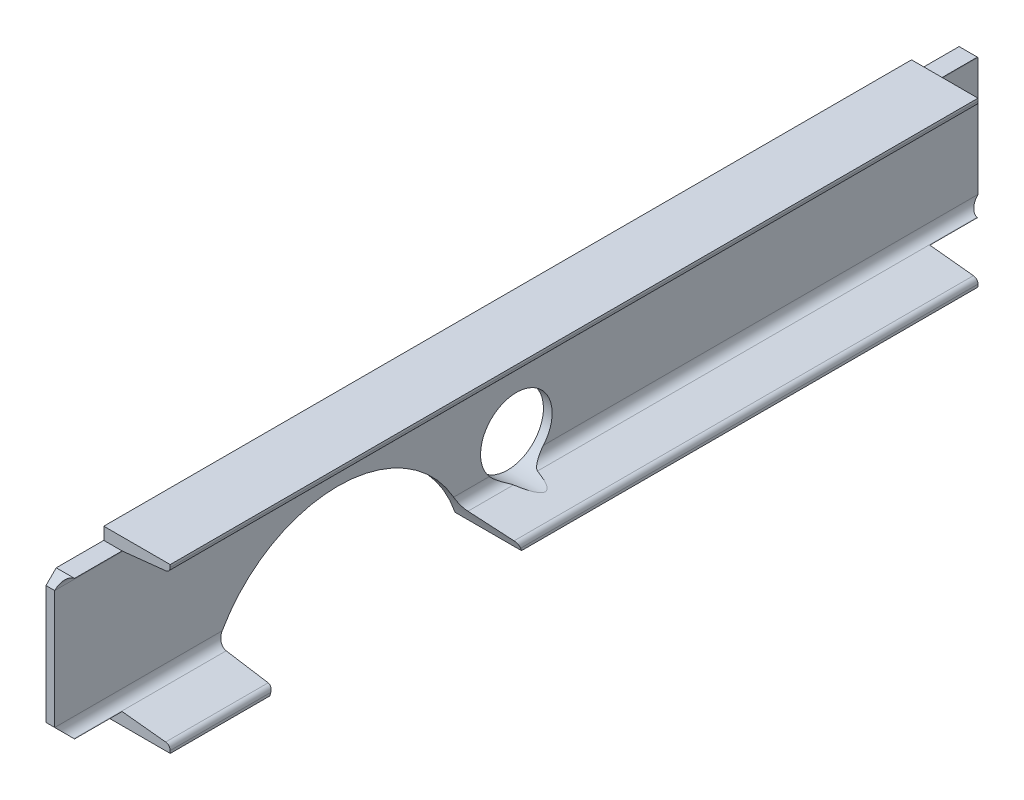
ISO-10303-21;
HEADER;
FILE_DESCRIPTION(('STEP AP214'),'2;1');
FILE_NAME('part.step','',(''),(''),'','','');
FILE_SCHEMA(('AUTOMOTIVE_DESIGN { 1 0 10303 214 1 1 1 1 }'));
ENDSEC;
DATA;
#1=APPLICATION_CONTEXT('core data for automotive mechanical design processes');
#2=APPLICATION_PROTOCOL_DEFINITION('international standard','automotive_design',2000,#1);
#3=PRODUCT_CONTEXT('',#1,'mechanical');
#4=PRODUCT('Part','Part','',(#3));
#5=PRODUCT_RELATED_PRODUCT_CATEGORY('part','',(#4));
#6=PRODUCT_DEFINITION_FORMATION('','',#4);
#7=PRODUCT_DEFINITION_CONTEXT('part definition',#1,'design');
#8=PRODUCT_DEFINITION('design','',#6,#7);
#9=PRODUCT_DEFINITION_SHAPE('','',#8);
#10=(LENGTH_UNIT() NAMED_UNIT(*) SI_UNIT(.MILLI.,.METRE.));
#11=(NAMED_UNIT(*) PLANE_ANGLE_UNIT() SI_UNIT($,.RADIAN.));
#12=(NAMED_UNIT(*) SI_UNIT($,.STERADIAN.) SOLID_ANGLE_UNIT());
#13=UNCERTAINTY_MEASURE_WITH_UNIT(LENGTH_MEASURE(1.E-05),#10,'distance_accuracy_value','');
#14=(GEOMETRIC_REPRESENTATION_CONTEXT(3) GLOBAL_UNCERTAINTY_ASSIGNED_CONTEXT((#13)) GLOBAL_UNIT_ASSIGNED_CONTEXT((#10,
#11,#12)) REPRESENTATION_CONTEXT('',''));
#15=CARTESIAN_POINT('',(0.,0.,0.));
#16=DIRECTION('',(0.,0.,1.));
#17=DIRECTION('',(1.,0.,0.));
#18=AXIS2_PLACEMENT_3D('',#15,#16,#17);
#19=CARTESIAN_POINT('',(18.5,-58.0057184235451,451.5));
#20=DIRECTION('',(0.,0.,-1.));
#21=DIRECTION('',(-1.,0.,0.));
#22=AXIS2_PLACEMENT_3D('',#19,#20,#21);
#23=CYLINDRICAL_SURFACE('',#22,9.99999999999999);
#24=DIRECTION('',(0.,0.,-1.));
#25=VECTOR('',#24,1.);
#26=CARTESIAN_POINT('',(17.4439908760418,-67.9498043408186,451.5));
#27=LINE('',#26,#25);
#28=CARTESIAN_POINT('',(17.4439908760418,-67.9498043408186,-11.8029824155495));
#29=VERTEX_POINT('',#28);
#30=CARTESIAN_POINT('',(17.4439908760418,-67.9498043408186,-441.550195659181));
#31=VERTEX_POINT('',#30);
#32=EDGE_CURVE('E301',#29,#31,#27,.T.);
#33=ORIENTED_EDGE('',*,*,#32,.T.);
#34=CARTESIAN_POINT('',(18.5,-58.0057184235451,-451.494281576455));
#35=DIRECTION('',(0.,-0.707106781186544,-0.707106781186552));
#36=DIRECTION('',(0.,0.707106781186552,-0.707106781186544));
#37=AXIS2_PLACEMENT_3D('',#34,#35,#36);
#38=ELLIPSE('',#37,14.1421356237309,9.99999999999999);
#39=CARTESIAN_POINT('',(8.50000000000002,-58.0057184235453,-451.494281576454));
#40=VERTEX_POINT('',#39);
#41=EDGE_CURVE('E362',#31,#40,#38,.T.);
#42=ORIENTED_EDGE('',*,*,#41,.T.);
#43=DIRECTION('',(0.,0.,-1.));
#44=VECTOR('',#43,1.);
#45=CARTESIAN_POINT('',(8.50000000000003,-58.0057184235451,451.5));
#46=LINE('',#45,#44);
#47=CARTESIAN_POINT('',(8.50000000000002,-58.0057184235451,-26.3768254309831));
#48=VERTEX_POINT('',#47);
#49=EDGE_CURVE('E299',#48,#40,#46,.T.);
#50=ORIENTED_EDGE('',*,*,#49,.F.);
#51=CARTESIAN_POINT('',(8.50000000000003,-58.0057184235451,-26.3768254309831));
#52=CARTESIAN_POINT('',(8.50004204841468,-58.3246674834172,-26.0986965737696));
#53=CARTESIAN_POINT('',(8.51525402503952,-58.6383669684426,-25.8148511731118));
#54=CARTESIAN_POINT('',(8.57335538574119,-59.253634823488,-25.2376332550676));
#55=CARTESIAN_POINT('',(8.61621529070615,-59.5552157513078,-24.9442712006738));
#56=CARTESIAN_POINT('',(8.72690583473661,-60.1450031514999,-24.3496253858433));
#57=CARTESIAN_POINT('',(8.79471138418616,-60.4332227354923,-24.048349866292));
#58=CARTESIAN_POINT('',(8.95306821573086,-60.9959636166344,-23.4388988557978));
#59=CARTESIAN_POINT('',(9.04362875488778,-61.2704792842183,-23.1307206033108));
#60=CARTESIAN_POINT('',(9.29859413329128,-61.9458168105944,-22.3453409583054));
#61=CARTESIAN_POINT('',(9.47679327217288,-62.337185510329,-21.8644400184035));
#62=CARTESIAN_POINT('',(9.87612784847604,-63.0859784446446,-20.8938679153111));
#63=CARTESIAN_POINT('',(10.0972833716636,-63.4433866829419,-20.4041927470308));
#64=CARTESIAN_POINT('',(10.4585684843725,-63.9537232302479,-19.6665059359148));
#65=CARTESIAN_POINT('',(10.58394523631,-64.1195646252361,-19.4200404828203));
#66=CARTESIAN_POINT('',(10.844364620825,-64.4426676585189,-18.9266014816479));
#67=CARTESIAN_POINT('',(10.9794064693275,-64.5999299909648,-18.6796279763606));
#68=CARTESIAN_POINT('',(11.2590192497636,-64.9057991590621,-18.1859141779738));
#69=CARTESIAN_POINT('',(11.4035858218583,-65.0544098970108,-17.9391738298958));
#70=CARTESIAN_POINT('',(11.7024141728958,-65.3430188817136,-17.4465661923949));
#71=CARTESIAN_POINT('',(11.8566748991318,-65.4830180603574,-17.2006988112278));
#72=CARTESIAN_POINT('',(12.1669784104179,-65.7473065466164,-16.7234454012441));
#73=CARTESIAN_POINT('',(12.3225116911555,-65.8720341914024,-16.4919709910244));
#74=CARTESIAN_POINT('',(12.6431649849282,-66.1136025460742,-16.0315718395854));
#75=CARTESIAN_POINT('',(12.8082843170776,-66.230443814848,-15.8026469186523));
#76=CARTESIAN_POINT('',(13.1493825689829,-66.456330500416,-15.3480886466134));
#77=CARTESIAN_POINT('',(13.3253859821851,-66.5653570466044,-15.1224642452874));
#78=CARTESIAN_POINT('',(13.6891808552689,-66.7749898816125,-14.676872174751));
#79=CARTESIAN_POINT('',(13.8769705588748,-66.8755974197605,-14.4569036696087));
#80=CARTESIAN_POINT('',(14.2239957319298,-67.0469932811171,-14.0721168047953));
#81=CARTESIAN_POINT('',(14.3805844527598,-67.1195148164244,-13.9056891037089));
#82=CARTESIAN_POINT('',(14.703446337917,-67.2586700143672,-13.5797491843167));
#83=CARTESIAN_POINT('',(14.8697221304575,-67.3253020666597,-13.4202388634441));
#84=CARTESIAN_POINT('',(15.2120769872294,-67.4514884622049,-13.1121453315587));
#85=CARTESIAN_POINT('',(15.3880639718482,-67.5110966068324,-12.9634829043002));
#86=CARTESIAN_POINT('',(15.7527350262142,-67.6228338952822,-12.6796662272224));
#87=CARTESIAN_POINT('',(15.9414092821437,-67.6749687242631,-12.5445017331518));
#88=CARTESIAN_POINT('',(16.3380869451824,-67.7714073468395,-12.2903903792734));
#89=CARTESIAN_POINT('',(16.5464331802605,-67.8155052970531,-12.1718839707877));
#90=CARTESIAN_POINT('',(16.872249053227,-67.8729745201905,-12.0154372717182));
#91=CARTESIAN_POINT('',(16.9837251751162,-67.890758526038,-11.9666306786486));
#92=CARTESIAN_POINT('',(17.2108309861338,-67.9229379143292,-11.8778102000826));
#93=CARTESIAN_POINT('',(17.3264681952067,-67.93732676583,-11.8378132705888));
#94=CARTESIAN_POINT('',(17.4439908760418,-67.9498043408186,-11.8029824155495));
#95=B_SPLINE_CURVE_WITH_KNOTS('',3,(#51,#52,#53,#54,#55,#56,#57,#58,#59,#60,#61,#62,#63,#64,#65,
#66,#67,#68,#69,#70,#71,#72,#73,#74,#75,#76,#77,#78,#79,#80,#81,#82,#83,#84,#85,#86,#87,#88,#89,
#90,#91,#92,#93,#94),.UNSPECIFIED.,.F.,.F.,(4,2,2,2,2,2,2,2,2,2,2,2,2,2,2,2,2,2,2,2,2,4),(0.,
1.26891953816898,2.53648834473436,3.80278573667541,5.06959911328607,7.00227511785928,
8.9358569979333,9.90296644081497,10.8699975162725,11.8365889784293,12.8030756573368,
13.7193204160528,14.635500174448,15.5538225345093,16.4720083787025,17.1909446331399,
17.9100768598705,18.6232828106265,19.335943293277,20.0648659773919,20.4334311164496,
20.8026995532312),.UNSPECIFIED.);
#96=EDGE_CURVE('E277',#48,#29,#95,.T.);
#97=ORIENTED_EDGE('',*,*,#96,.T.);
#98=EDGE_LOOP('',(#33,#42,#50,#97));
#99=FACE_BOUND('',#98,.T.);
#100=ADVANCED_FACE('F63',(#99),#23,.F.);
#101=CARTESIAN_POINT('',(0.,-80.,451.5));
#102=DIRECTION('',(0.,1.,0.));
#103=DIRECTION('',(-1.,0.,0.));
#104=AXIS2_PLACEMENT_3D('',#101,#102,#103);
#105=PLANE('',#104);
#106=DIRECTION('',(0.,0.,-1.));
#107=VECTOR('',#106,1.);
#108=CARTESIAN_POINT('',(65.,-80.,451.5));
#109=LINE('',#108,#107);
#110=CARTESIAN_POINT('',(65.,-80.,51.4715480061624));
#111=VERTEX_POINT('',#110);
#112=CARTESIAN_POINT('',(65.,-80.,-395.));
#113=VERTEX_POINT('',#112);
#114=EDGE_CURVE('E316',#111,#113,#109,.T.);
#115=ORIENTED_EDGE('',*,*,#114,.F.);
#116=DIRECTION('',(-1.,0.,0.));
#117=VECTOR('',#116,1.);
#118=CARTESIAN_POINT('',(65.,-80.,51.4715480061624));
#119=LINE('',#118,#117);
#120=CARTESIAN_POINT('',(0.,-80.,51.4715480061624));
#121=VERTEX_POINT('',#120);
#122=EDGE_CURVE('E517',#111,#121,#119,.T.);
#123=ORIENTED_EDGE('',*,*,#122,.T.);
#124=DIRECTION('',(0.,0.,-1.));
#125=VECTOR('',#124,1.);
#126=CARTESIAN_POINT('',(0.,-80.,451.5));
#127=LINE('',#126,#125);
#128=CARTESIAN_POINT('',(0.,-80.,-395.));
#129=VERTEX_POINT('',#128);
#130=EDGE_CURVE('E320',#121,#129,#127,.T.);
#131=ORIENTED_EDGE('',*,*,#130,.T.);
#132=DIRECTION('',(1.,0.,0.));
#133=VECTOR('',#132,1.);
#134=CARTESIAN_POINT('',(65.,-80.,-395.));
#135=LINE('',#134,#133);
#136=EDGE_CURVE('E820',#129,#113,#135,.T.);
#137=ORIENTED_EDGE('',*,*,#136,.T.);
#138=EDGE_LOOP('',(#115,#123,#131,#137));
#139=FACE_BOUND('',#138,.T.);
#140=ADVANCED_FACE('F585',(#139),#105,.F.);
#141=CARTESIAN_POINT('',(65.,-80.,451.5));
#142=DIRECTION('',(-1.,0.,0.));
#143=DIRECTION('',(0.,-1.,0.));
#144=AXIS2_PLACEMENT_3D('',#141,#142,#143);
#145=PLANE('',#144);
#146=CARTESIAN_POINT('',(65.,-80.,395.));
#147=VERTEX_POINT('',#146);
#148=CARTESIAN_POINT('',(65.,-80.,297.528451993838));
#149=VERTEX_POINT('',#148);
#150=EDGE_CURVE('E317',#147,#149,#109,.T.);
#151=ORIENTED_EDGE('',*,*,#150,.T.);
#152=CARTESIAN_POINT('',(65.,-122.,174.5));
#153=DIRECTION('',(-1.,0.,0.));
#154=DIRECTION('',(0.,-1.,0.));
#155=AXIS2_PLACEMENT_3D('',#152,#153,#154);
#156=CIRCLE('',#155,130.);
#157=CARTESIAN_POINT('',(65.,-77.4971407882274,296.645386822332));
#158=VERTEX_POINT('',#157);
#159=EDGE_CURVE('E511',#149,#158,#156,.T.);
#160=ORIENTED_EDGE('',*,*,#159,.T.);
#161=DIRECTION('',(0.,0.,-1.));
#162=VECTOR('',#161,1.);
#163=CARTESIAN_POINT('',(65.,-77.4971407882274,451.5));
#164=LINE('',#163,#162);
#165=CARTESIAN_POINT('',(65.,-77.4971407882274,395.));
#166=VERTEX_POINT('',#165);
#167=EDGE_CURVE('E313',#166,#158,#164,.T.);
#168=ORIENTED_EDGE('',*,*,#167,.F.);
#169=DIRECTION('',(0.,1.,0.));
#170=VECTOR('',#169,1.);
#171=CARTESIAN_POINT('',(65.,-80.,395.));
#172=LINE('',#171,#170);
#173=EDGE_CURVE('E485',#147,#166,#172,.T.);
#174=ORIENTED_EDGE('',*,*,#173,.F.);
#175=EDGE_LOOP('',(#151,#160,#168,#174));
#176=FACE_BOUND('',#175,.T.);
#177=ADVANCED_FACE('F581',(#176),#145,.F.);
#178=CARTESIAN_POINT('',(60.,-77.4971407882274,451.5));
#179=DIRECTION('',(0.,0.,-1.));
#180=DIRECTION('',(-1.,0.,0.));
#181=AXIS2_PLACEMENT_3D('',#178,#179,#180);
#182=CYLINDRICAL_SURFACE('',#181,5.);
#183=ORIENTED_EDGE('',*,*,#167,.T.);
#184=CARTESIAN_POINT('',(65.,-77.4971407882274,296.645386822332));
#185=CARTESIAN_POINT('',(65.0000095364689,-77.3483006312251,296.591160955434));
#186=CARTESIAN_POINT('',(64.9933544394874,-77.1995647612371,296.536658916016));
#187=CARTESIAN_POINT('',(64.9668377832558,-76.9033297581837,296.427499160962));
#188=CARTESIAN_POINT('',(64.9469760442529,-76.7558306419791,296.372841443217));
#189=CARTESIAN_POINT('',(64.8941420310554,-76.4629523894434,296.263712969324));
#190=CARTESIAN_POINT('',(64.861156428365,-76.3175755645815,296.209242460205));
#191=CARTESIAN_POINT('',(64.7822653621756,-76.0301202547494,296.100961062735));
#192=CARTESIAN_POINT('',(64.7363601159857,-75.8880417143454,296.047150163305));
#193=CARTESIAN_POINT('',(64.6318345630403,-75.6081077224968,295.940581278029));
#194=CARTESIAN_POINT('',(64.5732057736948,-75.4702551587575,295.887824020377));
#195=CARTESIAN_POINT('',(64.4435291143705,-75.1998511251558,295.783828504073));
#196=CARTESIAN_POINT('',(64.3724769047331,-75.0673015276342,295.732590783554));
#197=CARTESIAN_POINT('',(64.2183945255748,-74.8086865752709,295.632155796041));
#198=CARTESIAN_POINT('',(64.1353734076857,-74.6826164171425,295.582957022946));
#199=CARTESIAN_POINT('',(63.9577651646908,-74.4379007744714,295.487040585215));
#200=CARTESIAN_POINT('',(63.8631787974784,-74.3192548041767,295.440322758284));
#201=CARTESIAN_POINT('',(63.6655624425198,-74.0933802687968,295.351024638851));
#202=CARTESIAN_POINT('',(63.5628131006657,-73.9859361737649,295.308368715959));
#203=CARTESIAN_POINT('',(63.3474934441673,-73.7800908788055,295.226354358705));
#204=CARTESIAN_POINT('',(63.2349272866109,-73.6816858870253,295.186994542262));
#205=CARTESIAN_POINT('',(63.0005789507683,-73.4947659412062,295.111991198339));
#206=CARTESIAN_POINT('',(62.8787910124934,-73.4062572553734,295.076350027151));
#207=CARTESIAN_POINT('',(62.6269148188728,-73.2401381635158,295.009268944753));
#208=CARTESIAN_POINT('',(62.4968275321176,-73.1625264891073,294.977828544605));
#209=CARTESIAN_POINT('',(62.2382649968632,-73.0238608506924,294.921522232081));
#210=CARTESIAN_POINT('',(62.1102616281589,-72.9620475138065,294.896357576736));
#211=CARTESIAN_POINT('',(61.8487950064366,-72.8493221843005,294.850382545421));
#212=CARTESIAN_POINT('',(61.7153323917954,-72.7984089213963,294.829571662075));
#213=CARTESIAN_POINT('',(61.444303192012,-72.7081593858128,294.792629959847));
#214=CARTESIAN_POINT('',(61.3067477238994,-72.6687944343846,294.776487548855));
#215=CARTESIAN_POINT('',(61.0283779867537,-72.6019493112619,294.749049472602));
#216=CARTESIAN_POINT('',(60.8875662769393,-72.5744601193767,294.73775012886));
#217=CARTESIAN_POINT('',(60.7095613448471,-72.5476090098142,294.726706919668));
#218=CARTESIAN_POINT('',(60.6733131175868,-72.5425478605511,294.724624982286));
#219=CARTESIAN_POINT('',(60.6007292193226,-72.5332249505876,294.720789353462));
#220=CARTESIAN_POINT('',(60.5643936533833,-72.5289624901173,294.719035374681));
#221=CARTESIAN_POINT('',(60.5280045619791,-72.5250978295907,294.717444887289));
#222=B_SPLINE_CURVE_WITH_KNOTS('',3,(#184,#185,#186,#187,#188,#189,#190,#191,#192,#193,#194,
#195,#196,#197,#198,#199,#200,#201,#202,#203,#204,#205,#206,#207,#208,#209,#210,#211,#212,#213,
#214,#215,#216,#217,#218,#219,#220,#221),.UNSPECIFIED.,.F.,.F.,(4,2,2,2,2,2,2,2,2,2,2,2,2,2,2,2,
2,2,4),(0.,0.475086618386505,0.950179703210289,1.42575652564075,1.90132534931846,
2.37721220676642,2.85326563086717,3.32896090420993,3.80462502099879,4.26802271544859,
4.73122512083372,5.19471927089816,5.65815942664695,6.09066873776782,6.52312761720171,
6.95450326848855,7.38555069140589,7.49552158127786,7.60539566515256),.UNSPECIFIED.);
#223=CARTESIAN_POINT('',(60.5280045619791,-72.5250978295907,294.717444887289));
#224=VERTEX_POINT('',#223);
#225=EDGE_CURVE('E561',#158,#224,#222,.T.);
#226=ORIENTED_EDGE('',*,*,#225,.T.);
#227=DIRECTION('',(0.,0.,-1.));
#228=VECTOR('',#227,1.);
#229=CARTESIAN_POINT('',(60.5280045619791,-72.5250978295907,451.5));
#230=LINE('',#229,#228);
#231=CARTESIAN_POINT('',(60.5280045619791,-72.5250978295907,395.));
#232=VERTEX_POINT('',#231);
#233=EDGE_CURVE('E309',#232,#224,#230,.T.);
#234=ORIENTED_EDGE('',*,*,#233,.F.);
#235=CARTESIAN_POINT('',(60.,-77.4971407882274,395.));
#236=DIRECTION('',(0.,0.,1.));
#237=DIRECTION('',(1.,0.,0.));
#238=AXIS2_PLACEMENT_3D('',#235,#236,#237);
#239=CIRCLE('',#238,5.);
#240=EDGE_CURVE('E422',#166,#232,#239,.T.);
#241=ORIENTED_EDGE('',*,*,#240,.F.);
#242=EDGE_LOOP('',(#183,#226,#234,#241));
#243=FACE_BOUND('',#242,.T.);
#244=ADVANCED_FACE('F576',(#243),#182,.T.);
#245=CARTESIAN_POINT('',(60.5280045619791,-72.5250978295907,451.5));
#246=DIRECTION('',(-0.105600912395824,-0.994408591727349,0.));
#247=DIRECTION('',(0.994408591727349,-0.105600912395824,0.));
#248=AXIS2_PLACEMENT_3D('',#245,#246,#247);
#249=PLANE('',#248);
#250=DIRECTION('',(0.,0.,1.));
#251=VECTOR('',#250,1.);
#252=CARTESIAN_POINT('',(17.9166666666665,-68.,451.5));
#253=LINE('',#252,#251);
#254=CARTESIAN_POINT('',(17.9166666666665,-68.,-441.5));
#255=VERTEX_POINT('',#254);
#256=CARTESIAN_POINT('',(17.9166666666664,-68.,-395.));
#257=VERTEX_POINT('',#256);
#258=EDGE_CURVE('E342',#255,#257,#253,.T.);
#259=ORIENTED_EDGE('',*,*,#258,.F.);
#260=DIRECTION('',(-0.98890993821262,0.10501698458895,-0.105016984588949));
#261=VECTOR('',#260,1.);
#262=CARTESIAN_POINT('',(56.9947154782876,-72.1498812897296,-437.35011871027));
#263=LINE('',#262,#261);
#264=EDGE_CURVE('E360',#255,#31,#263,.T.);
#265=ORIENTED_EDGE('',*,*,#264,.T.);
#266=ORIENTED_EDGE('',*,*,#32,.F.);
#267=CARTESIAN_POINT('',(-292.833333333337,-35.,0.));
#268=DIRECTION('',(-0.105600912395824,-0.994408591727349,0.));
#269=DIRECTION('',(-0.994408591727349,0.105600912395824,0.));
#270=AXIS2_PLACEMENT_3D('',#267,#268,#269);
#271=ELLIPSE('',#270,331.436530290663,35.);
#272=CARTESIAN_POINT('',(17.4439908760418,-67.9498043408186,11.8029824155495));
#273=VERTEX_POINT('',#272);
#274=EDGE_CURVE('E508',#29,#273,#271,.T.);
#275=ORIENTED_EDGE('',*,*,#274,.T.);
#276=CARTESIAN_POINT('',(17.4439908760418,-67.9498043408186,56.268970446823));
#277=VERTEX_POINT('',#276);
#278=EDGE_CURVE('E292',#277,#273,#27,.T.);
#279=ORIENTED_EDGE('',*,*,#278,.F.);
#280=CARTESIAN_POINT('',(526.416666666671,-122.,174.5));
#281=DIRECTION('',(-0.105600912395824,-0.994408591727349,0.));
#282=DIRECTION('',(-0.994408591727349,0.105600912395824,0.));
#283=AXIS2_PLACEMENT_3D('',#280,#281,#282);
#284=ELLIPSE('',#283,1231.04996965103,130.);
#285=CARTESIAN_POINT('',(60.5280045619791,-72.5250978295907,54.2825551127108));
#286=VERTEX_POINT('',#285);
#287=EDGE_CURVE('E562',#277,#286,#284,.T.);
#288=ORIENTED_EDGE('',*,*,#287,.T.);
#289=CARTESIAN_POINT('',(60.5280045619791,-72.5250978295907,-395.));
#290=VERTEX_POINT('',#289);
#291=EDGE_CURVE('E308',#286,#290,#230,.T.);
#292=ORIENTED_EDGE('',*,*,#291,.T.);
#293=DIRECTION('',(0.994408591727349,-0.105600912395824,0.));
#294=VECTOR('',#293,1.);
#295=CARTESIAN_POINT('',(60.5280045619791,-72.5250978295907,-395.));
#296=LINE('',#295,#294);
#297=EDGE_CURVE('E339',#257,#290,#296,.T.);
#298=ORIENTED_EDGE('',*,*,#297,.F.);
#299=EDGE_LOOP('',(#259,#265,#266,#275,#279,#288,#292,#298));
#300=FACE_BOUND('',#299,.T.);
#301=ADVANCED_FACE('F607',(#300),#249,.F.);
#302=ORIENTED_EDGE('',*,*,#278,.T.);
#303=CARTESIAN_POINT('',(17.4439908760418,-67.9498043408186,11.8029824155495));
#304=CARTESIAN_POINT('',(17.2761203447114,-67.9319757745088,11.8527621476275));
#305=CARTESIAN_POINT('',(17.1122459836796,-67.9102774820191,11.9129790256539));
#306=CARTESIAN_POINT('',(16.7934751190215,-67.8603455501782,12.050016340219));
#307=CARTESIAN_POINT('',(16.6385406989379,-67.8321425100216,12.1267589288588));
#308=CARTESIAN_POINT('',(16.3397629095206,-67.7707711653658,12.2916300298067));
#309=CARTESIAN_POINT('',(16.1957713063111,-67.7377000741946,12.3795318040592));
#310=CARTESIAN_POINT('',(15.9151352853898,-67.6669511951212,12.5650385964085));
#311=CARTESIAN_POINT('',(15.7785015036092,-67.6292669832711,12.6626571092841));
#312=CARTESIAN_POINT('',(15.4084985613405,-67.5190670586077,12.9440129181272));
#313=CARTESIAN_POINT('',(15.1824836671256,-67.4422440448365,13.1357135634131));
#314=CARTESIAN_POINT('',(14.7482160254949,-67.2781476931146,13.5339488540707));
#315=CARTESIAN_POINT('',(14.5399711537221,-67.190869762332,13.7404900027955));
#316=CARTESIAN_POINT('',(14.1355091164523,-67.0057912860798,14.1662962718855));
#317=CARTESIAN_POINT('',(13.9394920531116,-66.9078646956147,14.3856954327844));
#318=CARTESIAN_POINT('',(13.5603534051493,-66.7032046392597,14.8312835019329));
#319=CARTESIAN_POINT('',(13.3772301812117,-66.5964722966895,15.0574715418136));
#320=CARTESIAN_POINT('',(13.0169363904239,-66.3712712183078,15.5213337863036));
#321=CARTESIAN_POINT('',(12.8401085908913,-66.2525466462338,15.7591490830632));
#322=CARTESIAN_POINT('',(12.4972153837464,-66.0064127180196,16.2380692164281));
#323=CARTESIAN_POINT('',(12.3311518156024,-65.8790018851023,16.4791746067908));
#324=CARTESIAN_POINT('',(12.008982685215,-65.615580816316,16.9635570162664));
#325=CARTESIAN_POINT('',(11.8528827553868,-65.4795658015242,17.2068351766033));
#326=CARTESIAN_POINT('',(11.5502957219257,-65.1990604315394,17.6945160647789));
#327=CARTESIAN_POINT('',(11.4038096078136,-65.0545692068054,17.9389189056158));
#328=CARTESIAN_POINT('',(11.1212406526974,-64.7581658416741,18.4264042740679));
#329=CARTESIAN_POINT('',(10.9850936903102,-64.6063110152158,18.669484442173));
#330=CARTESIAN_POINT('',(10.7221177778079,-64.2942925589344,19.1553605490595));
#331=CARTESIAN_POINT('',(10.5952896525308,-64.1341281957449,19.3981564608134));
#332=CARTESIAN_POINT('',(10.2290513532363,-63.641238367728,20.1251578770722));
#333=CARTESIAN_POINT('',(10.0037749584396,-63.295998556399,20.6081714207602));
#334=CARTESIAN_POINT('',(9.60081328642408,-62.5845743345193,21.5505994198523));
#335=CARTESIAN_POINT('',(9.42178876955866,-62.2194759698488,22.0102629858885));
#336=CARTESIAN_POINT('',(9.10615069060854,-61.4589667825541,22.9188454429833));
#337=CARTESIAN_POINT('',(8.9695132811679,-61.0635731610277,23.3677702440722));
#338=CARTESIAN_POINT('',(8.80023577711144,-60.447125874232,24.0319839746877));
#339=CARTESIAN_POINT('',(8.74961699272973,-60.236796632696,24.2527875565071));
#340=CARTESIAN_POINT('',(8.66152662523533,-59.8090801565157,24.6901405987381));
#341=CARTESIAN_POINT('',(8.62405364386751,-59.5916936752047,24.9066905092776));
#342=CARTESIAN_POINT('',(8.56315065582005,-59.1497847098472,25.3354062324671));
#343=CARTESIAN_POINT('',(8.53975079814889,-58.9252479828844,25.5475616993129));
#344=CARTESIAN_POINT('',(8.50817797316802,-58.4699712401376,25.9664479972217));
#345=CARTESIAN_POINT('',(8.50001108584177,-58.2392287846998,26.1731766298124));
#346=CARTESIAN_POINT('',(8.50000000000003,-58.0057184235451,26.3768254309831));
#347=B_SPLINE_CURVE_WITH_KNOTS('',3,(#303,#304,#305,#306,#307,#308,#309,#310,#311,#312,#313,
#314,#315,#316,#317,#318,#319,#320,#321,#322,#323,#324,#325,#326,#327,#328,#329,#330,#331,#332,
#333,#334,#335,#336,#337,#338,#339,#340,#341,#342,#343,#344,#345,#346),.UNSPECIFIED.,.F.,.F.,(4,
2,2,2,2,2,2,2,2,2,2,2,2,2,2,2,2,2,2,2,2,4),(0.,0.526936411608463,1.05144285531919,
1.56662224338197,2.08252737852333,2.9994151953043,3.91670728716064,4.84637115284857,
5.77591660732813,6.73331420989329,7.69087499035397,8.64897236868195,9.60716820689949,
10.5588309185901,11.5105777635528,13.4133133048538,15.252438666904,17.090527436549,
18.0175666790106,18.944507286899,19.8734266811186,20.8027167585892),.UNSPECIFIED.);
#348=CARTESIAN_POINT('',(8.50000000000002,-58.0057184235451,26.3768254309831));
#349=VERTEX_POINT('',#348);
#350=EDGE_CURVE('E274',#273,#349,#347,.T.);
#351=ORIENTED_EDGE('',*,*,#350,.T.);
#352=CARTESIAN_POINT('',(8.50000000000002,-58.0057184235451,61.3420045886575));
#353=VERTEX_POINT('',#352);
#354=EDGE_CURVE('E290',#353,#349,#46,.T.);
#355=ORIENTED_EDGE('',*,*,#354,.F.);
#356=CARTESIAN_POINT('',(8.50000000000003,-58.0057184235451,61.3420045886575));
#357=CARTESIAN_POINT('',(8.49999214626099,-58.309831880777,61.1700037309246));
#358=CARTESIAN_POINT('',(8.51387377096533,-58.6146892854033,60.9992307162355));
#359=CARTESIAN_POINT('',(8.56976449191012,-59.2239134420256,60.6611514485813));
#360=CARTESIAN_POINT('',(8.61178578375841,-59.5282799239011,60.4938467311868));
#361=CARTESIAN_POINT('',(8.72460238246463,-60.1358781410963,60.1629939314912));
#362=CARTESIAN_POINT('',(8.79554863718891,-60.4390953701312,59.9994703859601));
#363=CARTESIAN_POINT('',(8.96644816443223,-61.0403605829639,59.6782317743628));
#364=CARTESIAN_POINT('',(9.0663977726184,-61.338409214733,59.5205159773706));
#365=CARTESIAN_POINT('',(9.29576017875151,-61.9277395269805,59.2115158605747));
#366=CARTESIAN_POINT('',(9.42526286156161,-62.218997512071,59.06025286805));
#367=CARTESIAN_POINT('',(9.71343367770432,-62.7909858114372,58.7658387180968));
#368=CARTESIAN_POINT('',(9.87209858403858,-63.0717172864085,58.6226866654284));
#369=CARTESIAN_POINT('',(10.2178598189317,-63.6191621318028,58.3459141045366));
#370=CARTESIAN_POINT('',(10.4048979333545,-63.8859027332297,58.2122748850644));
#371=CARTESIAN_POINT('',(10.8068849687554,-64.40283841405,57.9553721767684));
#372=CARTESIAN_POINT('',(11.0218300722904,-64.653035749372,57.832107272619));
#373=CARTESIAN_POINT('',(11.4567720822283,-65.1108550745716,57.608238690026));
#374=CARTESIAN_POINT('',(11.6743542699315,-65.3202642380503,57.5065945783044));
#375=CARTESIAN_POINT('',(12.130206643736,-65.7204902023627,57.313541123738));
#376=CARTESIAN_POINT('',(12.3684758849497,-65.9113078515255,57.2221313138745));
#377=CARTESIAN_POINT('',(12.8639640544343,-66.2718490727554,57.0503807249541));
#378=CARTESIAN_POINT('',(13.1211708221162,-66.4415859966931,56.9700329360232));
#379=CARTESIAN_POINT('',(13.6527017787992,-66.757821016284,56.821062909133));
#380=CARTESIAN_POINT('',(13.9270242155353,-66.9043214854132,56.7524394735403));
#381=CARTESIAN_POINT('',(14.4596916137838,-67.1573920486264,56.634374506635));
#382=CARTESIAN_POINT('',(14.7165158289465,-67.2665745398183,56.5836571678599));
#383=CARTESIAN_POINT('',(15.2399565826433,-67.4635353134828,56.4924332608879));
#384=CARTESIAN_POINT('',(15.5065714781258,-67.5513171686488,56.4519249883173));
#385=CARTESIAN_POINT('',(16.0485827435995,-67.7046943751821,56.3813013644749));
#386=CARTESIAN_POINT('',(16.3240078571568,-67.770206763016,56.351224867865));
#387=CARTESIAN_POINT('',(16.7412524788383,-67.8508654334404,56.3142475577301));
#388=CARTESIAN_POINT('',(16.8810702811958,-67.8748221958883,56.3032755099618));
#389=CARTESIAN_POINT('',(17.1617864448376,-67.9167891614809,56.2840669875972));
#390=CARTESIAN_POINT('',(17.3026848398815,-67.934799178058,56.2758305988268));
#391=CARTESIAN_POINT('',(17.4439908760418,-67.9498043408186,56.268970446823));
#392=B_SPLINE_CURVE_WITH_KNOTS('',3,(#356,#357,#358,#359,#360,#361,#362,#363,#364,#365,#366,
#367,#368,#369,#370,#371,#372,#373,#374,#375,#376,#377,#378,#379,#380,#381,#382,#383,#384,#385,
#386,#387,#388,#389,#390,#391),.UNSPECIFIED.,.F.,.F.,(4,2,2,2,2,2,2,2,2,2,2,2,2,2,2,2,2,4),(0.,
1.04793941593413,2.09633329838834,3.1502698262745,4.20407325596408,5.26112555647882,
6.31806095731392,7.37285643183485,8.42750777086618,9.38208408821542,10.3366168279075,
11.2905418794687,12.2443694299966,13.0941630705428,13.9438147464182,14.7965979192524,
15.2233010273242,15.6500175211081),.UNSPECIFIED.);
#393=EDGE_CURVE('E530',#353,#277,#392,.T.);
#394=ORIENTED_EDGE('',*,*,#393,.T.);
#395=EDGE_LOOP('',(#302,#351,#355,#394));
#396=FACE_BOUND('',#395,.T.);
#397=ADVANCED_FACE('F288',(#396),#23,.F.);
#398=CARTESIAN_POINT('',(0.,80.,451.5));
#399=DIRECTION('',(1.,0.,0.));
#400=DIRECTION('',(0.,1.,0.));
#401=AXIS2_PLACEMENT_3D('',#398,#399,#400);
#402=PLANE('',#401);
#403=CARTESIAN_POINT('',(0.,-35.,0.));
#404=DIRECTION('',(-1.,0.,0.));
#405=DIRECTION('',(0.,-1.,0.));
#406=AXIS2_PLACEMENT_3D('',#403,#404,#405);
#407=CIRCLE('',#406,35.);
#408=CARTESIAN_POINT('',(0.,-70.,0.));
#409=VERTEX_POINT('',#408);
#410=EDGE_CURVE('E293',#409,#409,#407,.T.);
#411=ORIENTED_EDGE('',*,*,#410,.F.);
#412=EDGE_LOOP('',(#411));
#413=FACE_BOUND('',#412,.T.);
#414=DIRECTION('',(0.,-1.,0.));
#415=VECTOR('',#414,1.);
#416=CARTESIAN_POINT('',(0.,80.,-451.5));
#417=LINE('',#416,#415);
#418=CARTESIAN_POINT('',(0.,57.9999999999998,-451.5));
#419=VERTEX_POINT('',#418);
#420=CARTESIAN_POINT('',(0.,-57.9999999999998,-451.5));
#421=VERTEX_POINT('',#420);
#422=EDGE_CURVE('E446',#419,#421,#417,.T.);
#423=ORIENTED_EDGE('',*,*,#422,.T.);
#424=DIRECTION('',(0.,-0.707106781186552,0.707106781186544));
#425=VECTOR('',#424,1.);
#426=CARTESIAN_POINT('',(0.,-57.9999999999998,-451.5));
#427=LINE('',#426,#425);
#428=CARTESIAN_POINT('',(0.,-68.,-441.5));
#429=VERTEX_POINT('',#428);
#430=EDGE_CURVE('E356',#421,#429,#427,.T.);
#431=ORIENTED_EDGE('',*,*,#430,.T.);
#432=DIRECTION('',(0.,0.,-1.));
#433=VECTOR('',#432,1.);
#434=CARTESIAN_POINT('',(0.,-68.,-395.));
#435=LINE('',#434,#433);
#436=CARTESIAN_POINT('',(0.,-68.,-395.));
#437=VERTEX_POINT('',#436);
#438=EDGE_CURVE('E636',#437,#429,#435,.T.);
#439=ORIENTED_EDGE('',*,*,#438,.F.);
#440=DIRECTION('',(0.,-1.,0.));
#441=VECTOR('',#440,1.);
#442=CARTESIAN_POINT('',(0.,-80.,-395.));
#443=LINE('',#442,#441);
#444=EDGE_CURVE('E822',#437,#129,#443,.T.);
#445=ORIENTED_EDGE('',*,*,#444,.T.);
#446=ORIENTED_EDGE('',*,*,#130,.F.);
#447=CARTESIAN_POINT('',(0.,-122.,174.5));
#448=DIRECTION('',(-1.,0.,0.));
#449=DIRECTION('',(0.,-1.,0.));
#450=AXIS2_PLACEMENT_3D('',#447,#448,#449);
#451=CIRCLE('',#450,130.);
#452=CARTESIAN_POINT('',(0.,-80.,297.528451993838));
#453=VERTEX_POINT('',#452);
#454=EDGE_CURVE('E503',#453,#121,#451,.T.);
#455=ORIENTED_EDGE('',*,*,#454,.F.);
#456=CARTESIAN_POINT('',(0.,-80.,395.));
#457=VERTEX_POINT('',#456);
#458=EDGE_CURVE('E321',#457,#453,#127,.T.);
#459=ORIENTED_EDGE('',*,*,#458,.F.);
#460=DIRECTION('',(0.,-1.,0.));
#461=VECTOR('',#460,1.);
#462=CARTESIAN_POINT('',(0.,-80.,395.));
#463=LINE('',#462,#461);
#464=CARTESIAN_POINT('',(0.,-68.,395.));
#465=VERTEX_POINT('',#464);
#466=EDGE_CURVE('E419',#465,#457,#463,.T.);
#467=ORIENTED_EDGE('',*,*,#466,.F.);
#468=DIRECTION('',(0.,0.,1.));
#469=VECTOR('',#468,1.);
#470=CARTESIAN_POINT('',(0.,-68.,395.));
#471=LINE('',#470,#469);
#472=CARTESIAN_POINT('',(0.,-68.,441.5));
#473=VERTEX_POINT('',#472);
#474=EDGE_CURVE('E412',#465,#473,#471,.T.);
#475=ORIENTED_EDGE('',*,*,#474,.T.);
#476=DIRECTION('',(0.,0.707106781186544,0.707106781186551));
#477=VECTOR('',#476,1.);
#478=CARTESIAN_POINT('',(0.,-68.,441.5));
#479=LINE('',#478,#477);
#480=CARTESIAN_POINT('',(0.,-57.9999999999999,451.5));
#481=VERTEX_POINT('',#480);
#482=EDGE_CURVE('E352',#473,#481,#479,.T.);
#483=ORIENTED_EDGE('',*,*,#482,.T.);
#484=DIRECTION('',(0.,-1.,0.));
#485=VECTOR('',#484,1.);
#486=CARTESIAN_POINT('',(0.,80.,451.5));
#487=LINE('',#486,#485);
#488=CARTESIAN_POINT('',(0.,57.9999999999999,451.5));
#489=VERTEX_POINT('',#488);
#490=EDGE_CURVE('E398',#489,#481,#487,.T.);
#491=ORIENTED_EDGE('',*,*,#490,.F.);
#492=DIRECTION('',(0.,0.707106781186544,-0.707106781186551));
#493=VECTOR('',#492,1.);
#494=CARTESIAN_POINT('',(0.,68.,441.5));
#495=LINE('',#494,#493);
#496=CARTESIAN_POINT('',(0.,68.,441.5));
#497=VERTEX_POINT('',#496);
#498=EDGE_CURVE('E350',#489,#497,#495,.T.);
#499=ORIENTED_EDGE('',*,*,#498,.T.);
#500=DIRECTION('',(0.,0.,1.));
#501=VECTOR('',#500,1.);
#502=CARTESIAN_POINT('',(0.,68.,395.));
#503=LINE('',#502,#501);
#504=CARTESIAN_POINT('',(0.,68.,395.));
#505=VERTEX_POINT('',#504);
#506=EDGE_CURVE('E437',#505,#497,#503,.T.);
#507=ORIENTED_EDGE('',*,*,#506,.F.);
#508=DIRECTION('',(0.,-1.,0.));
#509=VECTOR('',#508,1.);
#510=CARTESIAN_POINT('',(0.,80.,395.));
#511=LINE('',#510,#509);
#512=CARTESIAN_POINT('',(0.,80.,395.));
#513=VERTEX_POINT('',#512);
#514=EDGE_CURVE('E432',#513,#505,#511,.T.);
#515=ORIENTED_EDGE('',*,*,#514,.F.);
#516=DIRECTION('',(0.,0.,-1.));
#517=VECTOR('',#516,1.);
#518=CARTESIAN_POINT('',(0.,80.,451.5));
#519=LINE('',#518,#517);
#520=CARTESIAN_POINT('',(0.,80.,-395.));
#521=VERTEX_POINT('',#520);
#522=EDGE_CURVE('E324',#513,#521,#519,.T.);
#523=ORIENTED_EDGE('',*,*,#522,.T.);
#524=DIRECTION('',(0.,-1.,0.));
#525=VECTOR('',#524,1.);
#526=CARTESIAN_POINT('',(0.,80.,-395.));
#527=LINE('',#526,#525);
#528=CARTESIAN_POINT('',(0.,68.,-395.));
#529=VERTEX_POINT('',#528);
#530=EDGE_CURVE('E646',#521,#529,#527,.T.);
#531=ORIENTED_EDGE('',*,*,#530,.T.);
#532=DIRECTION('',(0.,0.,-1.));
#533=VECTOR('',#532,1.);
#534=CARTESIAN_POINT('',(0.,68.,-395.));
#535=LINE('',#534,#533);
#536=CARTESIAN_POINT('',(0.,68.,-441.5));
#537=VERTEX_POINT('',#536);
#538=EDGE_CURVE('E483',#529,#537,#535,.T.);
#539=ORIENTED_EDGE('',*,*,#538,.T.);
#540=DIRECTION('',(0.,-0.707106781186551,-0.707106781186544));
#541=VECTOR('',#540,1.);
#542=CARTESIAN_POINT('',(0.,57.9999999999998,-451.5));
#543=LINE('',#542,#541);
#544=EDGE_CURVE('E354',#537,#419,#543,.T.);
#545=ORIENTED_EDGE('',*,*,#544,.T.);
#546=EDGE_LOOP('',(#423,#431,#439,#445,#446,#455,#459,#467,#475,#483,#491,#499,#507,#515,#523,
#531,#539,#545));
#547=FACE_BOUND('',#546,.T.);
#548=ADVANCED_FACE('F417',(#413,#547),#402,.F.);
#549=CARTESIAN_POINT('',(60.,-77.4971407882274,-451.5));
#550=DIRECTION('',(0.,0.,1.));
#551=DIRECTION('',(1.,0.,0.));
#552=AXIS2_PLACEMENT_3D('',#549,#550,#551);
#553=PLANE('',#552);
#554=DIRECTION('',(0.,1.,0.));
#555=VECTOR('',#554,1.);
#556=CARTESIAN_POINT('',(8.50000000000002,-58.0057184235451,-451.5));
#557=LINE('',#556,#555);
#558=CARTESIAN_POINT('',(8.50000000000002,-57.9999999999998,-451.5));
#559=VERTEX_POINT('',#558);
#560=CARTESIAN_POINT('',(8.50000000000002,57.9999999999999,-451.5));
#561=VERTEX_POINT('',#560);
#562=EDGE_CURVE('E448',#559,#561,#557,.T.);
#563=ORIENTED_EDGE('',*,*,#562,.F.);
#564=DIRECTION('',(-1.,0.,0.));
#565=VECTOR('',#564,1.);
#566=CARTESIAN_POINT('',(0.,-57.9999999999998,-451.5));
#567=LINE('',#566,#565);
#568=EDGE_CURVE('E347',#559,#421,#567,.T.);
#569=ORIENTED_EDGE('',*,*,#568,.T.);
#570=ORIENTED_EDGE('',*,*,#422,.F.);
#571=DIRECTION('',(1.,0.,0.));
#572=VECTOR('',#571,1.);
#573=CARTESIAN_POINT('',(17.9166666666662,57.9999999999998,-451.5));
#574=LINE('',#573,#572);
#575=EDGE_CURVE('E282',#419,#561,#574,.T.);
#576=ORIENTED_EDGE('',*,*,#575,.T.);
#577=EDGE_LOOP('',(#563,#569,#570,#576));
#578=FACE_BOUND('',#577,.T.);
#579=ADVANCED_FACE('F584',(#578),#553,.F.);
#580=ORIENTED_EDGE('',*,*,#458,.T.);
#581=DIRECTION('',(-1.,0.,0.));
#582=VECTOR('',#581,1.);
#583=CARTESIAN_POINT('',(65.,-80.,297.528451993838));
#584=LINE('',#583,#582);
#585=EDGE_CURVE('E518',#149,#453,#584,.T.);
#586=ORIENTED_EDGE('',*,*,#585,.F.);
#587=ORIENTED_EDGE('',*,*,#150,.F.);
#588=DIRECTION('',(1.,0.,0.));
#589=VECTOR('',#588,1.);
#590=CARTESIAN_POINT('',(65.,-80.,395.));
#591=LINE('',#590,#589);
#592=EDGE_CURVE('E420',#457,#147,#591,.T.);
#593=ORIENTED_EDGE('',*,*,#592,.F.);
#594=EDGE_LOOP('',(#580,#586,#587,#593));
#595=FACE_BOUND('',#594,.T.);
#596=ADVANCED_FACE('F499',(#595),#105,.F.);
#597=CARTESIAN_POINT('',(65.,-77.4971407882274,52.3546131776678));
#598=VERTEX_POINT('',#597);
#599=CARTESIAN_POINT('',(65.,-77.4971407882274,-395.));
#600=VERTEX_POINT('',#599);
#601=EDGE_CURVE('E312',#598,#600,#164,.T.);
#602=ORIENTED_EDGE('',*,*,#601,.F.);
#603=EDGE_CURVE('E507',#598,#111,#156,.T.);
#604=ORIENTED_EDGE('',*,*,#603,.T.);
#605=ORIENTED_EDGE('',*,*,#114,.T.);
#606=DIRECTION('',(0.,1.,0.));
#607=VECTOR('',#606,1.);
#608=CARTESIAN_POINT('',(65.,-80.,-395.));
#609=LINE('',#608,#607);
#610=EDGE_CURVE('E819',#113,#600,#609,.T.);
#611=ORIENTED_EDGE('',*,*,#610,.T.);
#612=EDGE_LOOP('',(#602,#604,#605,#611));
#613=FACE_BOUND('',#612,.T.);
#614=ADVANCED_FACE('F574',(#613),#145,.F.);
#615=ORIENTED_EDGE('',*,*,#291,.F.);
#616=CARTESIAN_POINT('',(60.5280045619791,-72.5250978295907,54.2825551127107));
#617=CARTESIAN_POINT('',(60.6624232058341,-72.5393523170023,54.2766903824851));
#618=CARTESIAN_POINT('',(60.79614944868,-72.5590847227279,54.2685709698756));
#619=CARTESIAN_POINT('',(61.0612100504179,-72.6091999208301,54.2479742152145));
#620=CARTESIAN_POINT('',(61.1925451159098,-72.6395795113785,54.2354981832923));
#621=CARTESIAN_POINT('',(61.4514871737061,-72.710579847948,54.2063821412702));
#622=CARTESIAN_POINT('',(61.5791046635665,-72.7511678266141,54.1897554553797));
#623=CARTESIAN_POINT('',(61.83016905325,-72.8422173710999,54.1525246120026));
#624=CARTESIAN_POINT('',(61.9536157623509,-72.8926793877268,54.1319202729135));
#625=CARTESIAN_POINT('',(62.1954153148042,-73.0029461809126,54.086993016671));
#626=CARTESIAN_POINT('',(62.3137729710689,-73.0627418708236,54.0626737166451));
#627=CARTESIAN_POINT('',(62.5448147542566,-73.1911664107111,54.0105707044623));
#628=CARTESIAN_POINT('',(62.6574967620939,-73.2597985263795,53.9827857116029));
#629=CARTESIAN_POINT('',(62.9860446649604,-73.4781162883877,53.8946460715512));
#630=CARTESIAN_POINT('',(63.1925296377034,-73.64027725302,53.8294847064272));
#631=CARTESIAN_POINT('',(63.5837905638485,-73.9999841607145,53.6859384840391));
#632=CARTESIAN_POINT('',(63.7672920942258,-74.1987293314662,53.6071135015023));
#633=CARTESIAN_POINT('',(64.0987194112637,-74.6209378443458,53.4410230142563));
#634=CARTESIAN_POINT('',(64.2466273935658,-74.8444134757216,53.3537533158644));
#635=CARTESIAN_POINT('',(64.5134183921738,-75.3268025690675,53.1670525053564));
#636=CARTESIAN_POINT('',(64.6294874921,-75.5871061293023,53.0671978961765));
#637=CARTESIAN_POINT('',(64.8155770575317,-76.1222468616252,52.8640125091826));
#638=CARTESIAN_POINT('',(64.8856320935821,-76.397072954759,52.7606844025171));
#639=CARTESIAN_POINT('',(64.9546602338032,-76.8113129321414,52.6065886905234));
#640=CARTESIAN_POINT('',(64.9716627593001,-76.9480093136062,52.5559986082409));
#641=CARTESIAN_POINT('',(64.9943194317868,-77.2221368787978,52.4550726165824));
#642=CARTESIAN_POINT('',(64.999994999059,-77.3595661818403,52.404736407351));
#643=CARTESIAN_POINT('',(65.,-77.4971407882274,52.3546131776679));
#644=B_SPLINE_CURVE_WITH_KNOTS('',3,(#616,#617,#618,#619,#620,#621,#622,#623,#624,#625,#626,
#627,#628,#629,#630,#631,#632,#633,#634,#635,#636,#637,#638,#639,#640,#641,#642,#643),
.UNSPECIFIED.,.F.,.F.,(4,2,2,2,2,2,2,2,2,2,2,2,2,4),(0.,0.405749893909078,0.811377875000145,
1.21572010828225,1.62008080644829,2.02405027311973,2.42816946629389,3.236019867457,
4.07776697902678,4.91993427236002,5.82202230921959,6.72343182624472,7.16329162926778,
7.60231882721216),.UNSPECIFIED.);
#645=EDGE_CURVE('E554',#286,#598,#644,.T.);
#646=ORIENTED_EDGE('',*,*,#645,.T.);
#647=ORIENTED_EDGE('',*,*,#601,.T.);
#648=CARTESIAN_POINT('',(60.,-77.4971407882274,-395.));
#649=DIRECTION('',(0.,0.,-1.));
#650=DIRECTION('',(-1.,0.,0.));
#651=AXIS2_PLACEMENT_3D('',#648,#649,#650);
#652=CIRCLE('',#651,5.);
#653=EDGE_CURVE('E631',#290,#600,#652,.T.);
#654=ORIENTED_EDGE('',*,*,#653,.F.);
#655=EDGE_LOOP('',(#615,#646,#647,#654));
#656=FACE_BOUND('',#655,.T.);
#657=ADVANCED_FACE('F569',(#656),#182,.T.);
#658=CARTESIAN_POINT('',(17.4439908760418,-67.9498043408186,441.550195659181));
#659=VERTEX_POINT('',#658);
#660=CARTESIAN_POINT('',(17.4439908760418,-67.9498043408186,292.731029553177));
#661=VERTEX_POINT('',#660);
#662=EDGE_CURVE('E306',#659,#661,#27,.T.);
#663=ORIENTED_EDGE('',*,*,#662,.F.);
#664=DIRECTION('',(0.98890993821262,-0.10501698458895,-0.105016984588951));
#665=VECTOR('',#664,1.);
#666=CARTESIAN_POINT('',(63.9614766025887,-72.8897143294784,436.610285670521));
#667=LINE('',#666,#665);
#668=CARTESIAN_POINT('',(17.9166666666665,-68.,441.5));
#669=VERTEX_POINT('',#668);
#670=EDGE_CURVE('E71',#659,#669,#667,.T.);
#671=ORIENTED_EDGE('',*,*,#670,.T.);
#672=DIRECTION('',(0.,0.,-1.));
#673=VECTOR('',#672,1.);
#674=CARTESIAN_POINT('',(17.9166666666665,-68.,451.5));
#675=LINE('',#674,#673);
#676=CARTESIAN_POINT('',(17.9166666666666,-68.,395.));
#677=VERTEX_POINT('',#676);
#678=EDGE_CURVE('E414',#669,#677,#675,.T.);
#679=ORIENTED_EDGE('',*,*,#678,.T.);
#680=DIRECTION('',(-0.994408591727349,0.105600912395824,0.));
#681=VECTOR('',#680,1.);
#682=CARTESIAN_POINT('',(60.5280045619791,-72.5250978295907,395.));
#683=LINE('',#682,#681);
#684=EDGE_CURVE('E333',#232,#677,#683,.T.);
#685=ORIENTED_EDGE('',*,*,#684,.F.);
#686=ORIENTED_EDGE('',*,*,#233,.T.);
#687=EDGE_CURVE('E563',#224,#661,#284,.T.);
#688=ORIENTED_EDGE('',*,*,#687,.T.);
#689=EDGE_LOOP('',(#663,#671,#679,#685,#686,#688));
#690=FACE_BOUND('',#689,.T.);
#691=ADVANCED_FACE('F573',(#690),#249,.F.);
#692=CARTESIAN_POINT('',(17.4439908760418,67.9498043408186,451.5));
#693=DIRECTION('',(-0.105600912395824,0.994408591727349,0.));
#694=DIRECTION('',(-0.994408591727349,-0.105600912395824,0.));
#695=AXIS2_PLACEMENT_3D('',#692,#693,#694);
#696=PLANE('',#695);
#697=DIRECTION('',(0.,0.,-1.));
#698=VECTOR('',#697,1.);
#699=CARTESIAN_POINT('',(17.4439908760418,67.9498043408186,451.5));
#700=LINE('',#699,#698);
#701=CARTESIAN_POINT('',(17.4439908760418,67.9498043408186,441.550195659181));
#702=VERTEX_POINT('',#701);
#703=CARTESIAN_POINT('',(17.4439908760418,67.9498043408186,-441.550195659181));
#704=VERTEX_POINT('',#703);
#705=EDGE_CURVE('E456',#702,#704,#700,.T.);
#706=ORIENTED_EDGE('',*,*,#705,.T.);
#707=DIRECTION('',(0.98890993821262,0.10501698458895,0.105016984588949));
#708=VECTOR('',#707,1.);
#709=CARTESIAN_POINT('',(56.9947154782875,72.1498812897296,-437.35011871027));
#710=LINE('',#709,#708);
#711=CARTESIAN_POINT('',(17.9166666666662,68.,-441.5));
#712=VERTEX_POINT('',#711);
#713=EDGE_CURVE('E378',#704,#712,#710,.T.);
#714=ORIENTED_EDGE('',*,*,#713,.T.);
#715=DIRECTION('',(0.,0.,-1.));
#716=VECTOR('',#715,1.);
#717=CARTESIAN_POINT('',(17.9166666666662,68.,451.5));
#718=LINE('',#717,#716);
#719=CARTESIAN_POINT('',(17.9166666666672,68.,-395.));
#720=VERTEX_POINT('',#719);
#721=EDGE_CURVE('E475',#720,#712,#718,.T.);
#722=ORIENTED_EDGE('',*,*,#721,.F.);
#723=DIRECTION('',(0.994408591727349,0.105600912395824,0.));
#724=VECTOR('',#723,1.);
#725=CARTESIAN_POINT('',(17.4439908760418,67.9498043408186,-395.));
#726=LINE('',#725,#724);
#727=CARTESIAN_POINT('',(60.5280045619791,72.5250978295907,-395.));
#728=VERTEX_POINT('',#727);
#729=EDGE_CURVE('E482',#720,#728,#726,.T.);
#730=ORIENTED_EDGE('',*,*,#729,.T.);
#731=DIRECTION('',(0.,0.,-1.));
#732=VECTOR('',#731,1.);
#733=CARTESIAN_POINT('',(60.5280045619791,72.5250978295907,451.5));
#734=LINE('',#733,#732);
#735=CARTESIAN_POINT('',(60.5280045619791,72.5250978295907,395.));
#736=VERTEX_POINT('',#735);
#737=EDGE_CURVE('E454',#736,#728,#734,.T.);
#738=ORIENTED_EDGE('',*,*,#737,.F.);
#739=DIRECTION('',(-0.994408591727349,-0.105600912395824,0.));
#740=VECTOR('',#739,1.);
#741=CARTESIAN_POINT('',(17.4439908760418,67.9498043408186,395.));
#742=LINE('',#741,#740);
#743=CARTESIAN_POINT('',(17.9166666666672,68.,395.));
#744=VERTEX_POINT('',#743);
#745=EDGE_CURVE('E443',#736,#744,#742,.T.);
#746=ORIENTED_EDGE('',*,*,#745,.T.);
#747=DIRECTION('',(0.,0.,1.));
#748=VECTOR('',#747,1.);
#749=CARTESIAN_POINT('',(17.9166666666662,68.,451.5));
#750=LINE('',#749,#748);
#751=CARTESIAN_POINT('',(17.9166666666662,68.,441.5));
#752=VERTEX_POINT('',#751);
#753=EDGE_CURVE('E440',#744,#752,#750,.T.);
#754=ORIENTED_EDGE('',*,*,#753,.T.);
#755=DIRECTION('',(-0.98890993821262,-0.10501698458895,0.105016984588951));
#756=VECTOR('',#755,1.);
#757=CARTESIAN_POINT('',(63.9614766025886,72.8897143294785,436.610285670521));
#758=LINE('',#757,#756);
#759=EDGE_CURVE('E376',#752,#702,#758,.T.);
#760=ORIENTED_EDGE('',*,*,#759,.T.);
#761=EDGE_LOOP('',(#706,#714,#722,#730,#738,#746,#754,#760));
#762=FACE_BOUND('',#761,.T.);
#763=ADVANCED_FACE('F473',(#762),#696,.F.);
#764=CARTESIAN_POINT('',(65.,77.4971407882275,451.5));
#765=DIRECTION('',(-1.,0.,0.));
#766=DIRECTION('',(0.,-1.,0.));
#767=AXIS2_PLACEMENT_3D('',#764,#765,#766);
#768=PLANE('',#767);
#769=DIRECTION('',(0.,0.,-1.));
#770=VECTOR('',#769,1.);
#771=CARTESIAN_POINT('',(65.,77.4971407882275,451.5));
#772=LINE('',#771,#770);
#773=CARTESIAN_POINT('',(65.,77.4971407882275,395.));
#774=VERTEX_POINT('',#773);
#775=CARTESIAN_POINT('',(65.,77.4971407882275,-395.));
#776=VERTEX_POINT('',#775);
#777=EDGE_CURVE('E403',#774,#776,#772,.T.);
#778=ORIENTED_EDGE('',*,*,#777,.T.);
#779=DIRECTION('',(0.,1.,0.));
#780=VECTOR('',#779,1.);
#781=CARTESIAN_POINT('',(65.,80.,-395.));
#782=LINE('',#781,#780);
#783=CARTESIAN_POINT('',(65.,80.,-395.));
#784=VERTEX_POINT('',#783);
#785=EDGE_CURVE('E635',#776,#784,#782,.T.);
#786=ORIENTED_EDGE('',*,*,#785,.T.);
#787=DIRECTION('',(0.,0.,-1.));
#788=VECTOR('',#787,1.);
#789=CARTESIAN_POINT('',(65.,80.,451.5));
#790=LINE('',#789,#788);
#791=CARTESIAN_POINT('',(65.,80.,395.));
#792=VERTEX_POINT('',#791);
#793=EDGE_CURVE('E327',#792,#784,#790,.T.);
#794=ORIENTED_EDGE('',*,*,#793,.F.);
#795=DIRECTION('',(0.,1.,0.));
#796=VECTOR('',#795,1.);
#797=CARTESIAN_POINT('',(65.,80.,395.));
#798=LINE('',#797,#796);
#799=EDGE_CURVE('E428',#774,#792,#798,.T.);
#800=ORIENTED_EDGE('',*,*,#799,.F.);
#801=EDGE_LOOP('',(#778,#786,#794,#800));
#802=FACE_BOUND('',#801,.T.);
#803=ADVANCED_FACE('F65',(#802),#768,.F.);
#804=CARTESIAN_POINT('',(65.,80.,451.5));
#805=DIRECTION('',(0.,-1.,0.));
#806=DIRECTION('',(0.,0.,-1.));
#807=AXIS2_PLACEMENT_3D('',#804,#805,#806);
#808=PLANE('',#807);
#809=ORIENTED_EDGE('',*,*,#793,.T.);
#810=DIRECTION('',(-1.,0.,0.));
#811=VECTOR('',#810,1.);
#812=CARTESIAN_POINT('',(65.,80.,-395.));
#813=LINE('',#812,#811);
#814=EDGE_CURVE('E487',#784,#521,#813,.T.);
#815=ORIENTED_EDGE('',*,*,#814,.T.);
#816=ORIENTED_EDGE('',*,*,#522,.F.);
#817=DIRECTION('',(-1.,0.,0.));
#818=VECTOR('',#817,1.);
#819=CARTESIAN_POINT('',(65.,80.,395.));
#820=LINE('',#819,#818);
#821=EDGE_CURVE('E430',#792,#513,#820,.T.);
#822=ORIENTED_EDGE('',*,*,#821,.F.);
#823=EDGE_LOOP('',(#809,#815,#816,#822));
#824=FACE_BOUND('',#823,.T.);
#825=ADVANCED_FACE('F588',(#824),#808,.F.);
#826=CARTESIAN_POINT('',(8.50000000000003,-58.0057184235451,451.494281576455));
#827=VERTEX_POINT('',#826);
#828=CARTESIAN_POINT('',(8.50000000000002,-58.0057184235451,287.657995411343));
#829=VERTEX_POINT('',#828);
#830=EDGE_CURVE('E298',#827,#829,#46,.T.);
#831=ORIENTED_EDGE('',*,*,#830,.F.);
#832=CARTESIAN_POINT('',(18.5,-58.0057184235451,451.494281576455));
#833=DIRECTION('',(0.,-0.707106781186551,0.707106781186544));
#834=DIRECTION('',(0.,-0.707106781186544,-0.707106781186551));
#835=AXIS2_PLACEMENT_3D('',#832,#833,#834);
#836=ELLIPSE('',#835,14.142135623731,9.99999999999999);
#837=EDGE_CURVE('E78',#827,#659,#836,.T.);
#838=ORIENTED_EDGE('',*,*,#837,.T.);
#839=ORIENTED_EDGE('',*,*,#662,.T.);
#840=CARTESIAN_POINT('',(17.4439908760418,-67.9498043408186,292.731029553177));
#841=CARTESIAN_POINT('',(17.1796602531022,-67.9217760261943,292.718209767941));
#842=CARTESIAN_POINT('',(16.9167115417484,-67.883154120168,292.700547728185));
#843=CARTESIAN_POINT('',(16.3955619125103,-67.7853596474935,292.655728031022));
#844=CARTESIAN_POINT('',(16.1373596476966,-67.7261930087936,292.62857311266));
#845=CARTESIAN_POINT('',(15.6283857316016,-67.5881601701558,292.565055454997));
#846=CARTESIAN_POINT('',(15.3775920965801,-67.5093605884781,292.528723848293));
#847=CARTESIAN_POINT('',(14.8842639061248,-67.3328334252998,292.44706599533));
#848=CARTESIAN_POINT('',(14.6417296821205,-67.2351050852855,292.401739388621));
#849=CARTESIAN_POINT('',(14.1667028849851,-67.0218304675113,292.302439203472));
#850=CARTESIAN_POINT('',(13.9342028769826,-66.9062976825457,292.248472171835));
#851=CARTESIAN_POINT('',(13.4804528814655,-66.6585199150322,292.1322205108));
#852=CARTESIAN_POINT('',(13.2592036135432,-66.5262738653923,292.0699353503));
#853=CARTESIAN_POINT('',(12.8291117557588,-66.2462828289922,291.937417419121));
#854=CARTESIAN_POINT('',(12.6202747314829,-66.0985309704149,291.867181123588));
#855=CARTESIAN_POINT('',(12.2161646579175,-65.7889190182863,291.719212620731));
#856=CARTESIAN_POINT('',(12.020891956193,-65.6270585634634,291.641480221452));
#857=CARTESIAN_POINT('',(11.6367761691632,-65.2834485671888,291.475513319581));
#858=CARTESIAN_POINT('',(11.4485605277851,-65.101145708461,291.386972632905));
#859=CARTESIAN_POINT('',(11.0885547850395,-64.7242321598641,291.202743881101));
#860=CARTESIAN_POINT('',(10.9167703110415,-64.5296172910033,291.107053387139));
#861=CARTESIAN_POINT('',(10.5903053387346,-64.1297164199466,290.909106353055));
#862=CARTESIAN_POINT('',(10.4356237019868,-63.924431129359,290.806850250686));
#863=CARTESIAN_POINT('',(10.143730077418,-63.5046402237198,290.596287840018));
#864=CARTESIAN_POINT('',(10.006524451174,-63.2901312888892,290.487979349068));
#865=CARTESIAN_POINT('',(9.73768118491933,-62.8325934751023,290.255302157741));
#866=CARTESIAN_POINT('',(9.60782316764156,-62.5887959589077,290.130387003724));
#867=CARTESIAN_POINT('',(9.36963690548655,-62.0937454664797,289.874686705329));
#868=CARTESIAN_POINT('',(9.26131786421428,-61.8424893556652,289.743899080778));
#869=CARTESIAN_POINT('',(9.06633957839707,-61.3343939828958,289.477243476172));
#870=CARTESIAN_POINT('',(8.97967727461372,-61.0775555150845,289.341376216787));
#871=CARTESIAN_POINT('',(8.82792327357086,-60.559874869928,289.065253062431));
#872=CARTESIAN_POINT('',(8.7628347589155,-60.2990321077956,288.924996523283));
#873=CARTESIAN_POINT('',(8.63857894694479,-59.7000402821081,288.60022522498));
#874=CARTESIAN_POINT('',(8.58640587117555,-59.3610788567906,288.414505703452));
#875=CARTESIAN_POINT('',(8.51715188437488,-58.682988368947,288.03901260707));
#876=CARTESIAN_POINT('',(8.499978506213,-58.3438621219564,287.849251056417));
#877=CARTESIAN_POINT('',(8.50000000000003,-58.0057184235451,287.657995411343));
#878=B_SPLINE_CURVE_WITH_KNOTS('',3,(#840,#841,#842,#843,#844,#845,#846,#847,#848,#849,#850,
#851,#852,#853,#854,#855,#856,#857,#858,#859,#860,#861,#862,#863,#864,#865,#866,#867,#868,#869,
#870,#871,#872,#873,#874,#875,#876,#877),.UNSPECIFIED.,.F.,.F.,(4,2,2,2,2,2,2,2,2,2,2,2,2,2,2,2,
2,2,4),(0.,0.798075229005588,1.59592037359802,2.39109429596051,3.18630008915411,
3.98090618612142,4.77556304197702,5.57057357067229,6.36560446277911,7.19447502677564,
8.02362845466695,8.8527266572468,9.68212580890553,10.5906419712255,11.4995455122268,
12.4083205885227,13.3172296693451,14.4855971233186,15.650873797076),.UNSPECIFIED.);
#879=EDGE_CURVE('E520',#661,#829,#878,.T.);
#880=ORIENTED_EDGE('',*,*,#879,.T.);
#881=EDGE_LOOP('',(#831,#838,#839,#880));
#882=FACE_BOUND('',#881,.T.);
#883=ADVANCED_FACE('F536',(#882),#23,.F.);
#884=CARTESIAN_POINT('',(8.50000000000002,-58.0057184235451,451.5));
#885=DIRECTION('',(-1.,0.,0.));
#886=DIRECTION('',(0.,0.,1.));
#887=AXIS2_PLACEMENT_3D('',#884,#885,#886);
#888=PLANE('',#887);
#889=ORIENTED_EDGE('',*,*,#49,.T.);
#890=DIRECTION('',(0.,0.707106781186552,-0.707106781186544));
#891=VECTOR('',#890,1.);
#892=CARTESIAN_POINT('',(8.50000000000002,-57.9999999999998,-451.5));
#893=LINE('',#892,#891);
#894=EDGE_CURVE('E370',#40,#559,#893,.T.);
#895=ORIENTED_EDGE('',*,*,#894,.T.);
#896=ORIENTED_EDGE('',*,*,#562,.T.);
#897=DIRECTION('',(0.,0.707106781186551,0.707106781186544));
#898=VECTOR('',#897,1.);
#899=CARTESIAN_POINT('',(8.50000000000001,57.9999999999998,-451.5));
#900=LINE('',#899,#898);
#901=CARTESIAN_POINT('',(8.50000000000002,58.0057184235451,-451.494281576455));
#902=VERTEX_POINT('',#901);
#903=EDGE_CURVE('E368',#561,#902,#900,.T.);
#904=ORIENTED_EDGE('',*,*,#903,.T.);
#905=DIRECTION('',(0.,0.,-1.));
#906=VECTOR('',#905,1.);
#907=CARTESIAN_POINT('',(8.50000000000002,58.0057184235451,451.5));
#908=LINE('',#907,#906);
#909=CARTESIAN_POINT('',(8.50000000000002,58.0057184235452,451.494281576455));
#910=VERTEX_POINT('',#909);
#911=EDGE_CURVE('E302',#910,#902,#908,.T.);
#912=ORIENTED_EDGE('',*,*,#911,.F.);
#913=DIRECTION('',(0.,-0.707106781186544,0.707106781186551));
#914=VECTOR('',#913,1.);
#915=CARTESIAN_POINT('',(8.50000000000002,68.,441.5));
#916=LINE('',#915,#914);
#917=CARTESIAN_POINT('',(8.50000000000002,57.9999999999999,451.5));
#918=VERTEX_POINT('',#917);
#919=EDGE_CURVE('E364',#910,#918,#916,.T.);
#920=ORIENTED_EDGE('',*,*,#919,.T.);
#921=DIRECTION('',(0.,1.,0.));
#922=VECTOR('',#921,1.);
#923=CARTESIAN_POINT('',(8.50000000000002,-58.0057184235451,451.5));
#924=LINE('',#923,#922);
#925=CARTESIAN_POINT('',(8.50000000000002,-57.9999999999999,451.5));
#926=VERTEX_POINT('',#925);
#927=EDGE_CURVE('E395',#926,#918,#924,.T.);
#928=ORIENTED_EDGE('',*,*,#927,.F.);
#929=DIRECTION('',(0.,-0.707106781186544,-0.707106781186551));
#930=VECTOR('',#929,1.);
#931=CARTESIAN_POINT('',(8.50000000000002,-68.,441.5));
#932=LINE('',#931,#930);
#933=EDGE_CURVE('E366',#926,#827,#932,.T.);
#934=ORIENTED_EDGE('',*,*,#933,.T.);
#935=ORIENTED_EDGE('',*,*,#830,.T.);
#936=CARTESIAN_POINT('',(8.50000000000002,-122.,174.5));
#937=DIRECTION('',(-1.,0.,0.));
#938=DIRECTION('',(0.,0.,1.));
#939=AXIS2_PLACEMENT_3D('',#936,#937,#938);
#940=CIRCLE('',#939,130.);
#941=EDGE_CURVE('E283',#829,#353,#940,.T.);
#942=ORIENTED_EDGE('',*,*,#941,.T.);
#943=ORIENTED_EDGE('',*,*,#354,.T.);
#944=CARTESIAN_POINT('',(8.50000000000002,-35.,0.));
#945=DIRECTION('',(-1.,0.,0.));
#946=DIRECTION('',(0.,0.,1.));
#947=AXIS2_PLACEMENT_3D('',#944,#945,#946);
#948=CIRCLE('',#947,35.);
#949=EDGE_CURVE('E271',#349,#48,#948,.T.);
#950=ORIENTED_EDGE('',*,*,#949,.T.);
#951=EDGE_LOOP('',(#889,#895,#896,#904,#912,#920,#928,#934,#935,#942,#943,#950));
#952=FACE_BOUND('',#951,.T.);
#953=ADVANCED_FACE('F296',(#952),#888,.F.);
#954=CARTESIAN_POINT('',(18.5,58.0057184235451,451.5));
#955=DIRECTION('',(0.,0.,-1.));
#956=DIRECTION('',(-1.,0.,0.));
#957=AXIS2_PLACEMENT_3D('',#954,#955,#956);
#958=CYLINDRICAL_SURFACE('',#957,10.);
#959=ORIENTED_EDGE('',*,*,#911,.T.);
#960=CARTESIAN_POINT('',(18.5,58.0057184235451,-451.494281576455));
#961=DIRECTION('',(0.,0.707106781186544,-0.707106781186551));
#962=DIRECTION('',(0.,-0.707106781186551,-0.707106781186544));
#963=AXIS2_PLACEMENT_3D('',#960,#961,#962);
#964=ELLIPSE('',#963,14.1421356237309,10.);
#965=EDGE_CURVE('E374',#902,#704,#964,.T.);
#966=ORIENTED_EDGE('',*,*,#965,.T.);
#967=ORIENTED_EDGE('',*,*,#705,.F.);
#968=CARTESIAN_POINT('',(18.5,58.0057184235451,451.494281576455));
#969=DIRECTION('',(0.,0.707106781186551,0.707106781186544));
#970=DIRECTION('',(0.,0.707106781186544,-0.707106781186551));
#971=AXIS2_PLACEMENT_3D('',#968,#969,#970);
#972=ELLIPSE('',#971,14.142135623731,10.);
#973=EDGE_CURVE('E372',#702,#910,#972,.T.);
#974=ORIENTED_EDGE('',*,*,#973,.T.);
#975=EDGE_LOOP('',(#959,#966,#967,#974));
#976=FACE_BOUND('',#975,.T.);
#977=ADVANCED_FACE('F464',(#976),#958,.F.);
#978=CARTESIAN_POINT('',(60.,77.4971407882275,451.5));
#979=DIRECTION('',(0.,0.,-1.));
#980=DIRECTION('',(-1.,0.,0.));
#981=AXIS2_PLACEMENT_3D('',#978,#979,#980);
#982=CYLINDRICAL_SURFACE('',#981,5.);
#983=ORIENTED_EDGE('',*,*,#737,.T.);
#984=CARTESIAN_POINT('',(60.,77.4971407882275,-395.));
#985=DIRECTION('',(0.,0.,1.));
#986=DIRECTION('',(1.,0.,0.));
#987=AXIS2_PLACEMENT_3D('',#984,#985,#986);
#988=CIRCLE('',#987,5.);
#989=EDGE_CURVE('E336',#728,#776,#988,.T.);
#990=ORIENTED_EDGE('',*,*,#989,.T.);
#991=ORIENTED_EDGE('',*,*,#777,.F.);
#992=CARTESIAN_POINT('',(60.,77.4971407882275,395.));
#993=DIRECTION('',(0.,0.,-1.));
#994=DIRECTION('',(-1.,0.,0.));
#995=AXIS2_PLACEMENT_3D('',#992,#993,#994);
#996=CIRCLE('',#995,5.);
#997=EDGE_CURVE('E330',#774,#736,#996,.T.);
#998=ORIENTED_EDGE('',*,*,#997,.T.);
#999=EDGE_LOOP('',(#983,#990,#991,#998));
#1000=FACE_BOUND('',#999,.T.);
#1001=ADVANCED_FACE('F665',(#1000),#982,.T.);
#1002=CARTESIAN_POINT('',(60.,-77.4971407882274,451.5));
#1003=DIRECTION('',(0.,0.,1.));
#1004=DIRECTION('',(1.,0.,0.));
#1005=AXIS2_PLACEMENT_3D('',#1002,#1003,#1004);
#1006=PLANE('',#1005);
#1007=ORIENTED_EDGE('',*,*,#490,.T.);
#1008=DIRECTION('',(1.,0.,0.));
#1009=VECTOR('',#1008,1.);
#1010=CARTESIAN_POINT('',(17.9166666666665,-57.9999999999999,451.5));
#1011=LINE('',#1010,#1009);
#1012=EDGE_CURVE('E387',#481,#926,#1011,.T.);
#1013=ORIENTED_EDGE('',*,*,#1012,.T.);
#1014=ORIENTED_EDGE('',*,*,#927,.T.);
#1015=DIRECTION('',(-1.,0.,0.));
#1016=VECTOR('',#1015,1.);
#1017=CARTESIAN_POINT('',(0.,57.9999999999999,451.5));
#1018=LINE('',#1017,#1016);
#1019=EDGE_CURVE('E385',#918,#489,#1018,.T.);
#1020=ORIENTED_EDGE('',*,*,#1019,.T.);
#1021=EDGE_LOOP('',(#1007,#1013,#1014,#1020));
#1022=FACE_BOUND('',#1021,.T.);
#1023=ADVANCED_FACE('F394',(#1022),#1006,.T.);
#1024=CARTESIAN_POINT('',(65.,80.,395.));
#1025=DIRECTION('',(0.,0.,-1.));
#1026=DIRECTION('',(-1.,0.,0.));
#1027=AXIS2_PLACEMENT_3D('',#1024,#1025,#1026);
#1028=PLANE('',#1027);
#1029=ORIENTED_EDGE('',*,*,#997,.F.);
#1030=ORIENTED_EDGE('',*,*,#799,.T.);
#1031=ORIENTED_EDGE('',*,*,#821,.T.);
#1032=ORIENTED_EDGE('',*,*,#514,.T.);
#1033=DIRECTION('',(1.,0.,0.));
#1034=VECTOR('',#1033,1.);
#1035=CARTESIAN_POINT('',(65.,68.,395.));
#1036=LINE('',#1035,#1034);
#1037=EDGE_CURVE('E434',#505,#744,#1036,.T.);
#1038=ORIENTED_EDGE('',*,*,#1037,.T.);
#1039=ORIENTED_EDGE('',*,*,#745,.F.);
#1040=EDGE_LOOP('',(#1029,#1030,#1031,#1032,#1038,#1039));
#1041=FACE_BOUND('',#1040,.T.);
#1042=ADVANCED_FACE('F657',(#1041),#1028,.F.);
#1043=CARTESIAN_POINT('',(65.,68.,395.));
#1044=DIRECTION('',(0.,-1.,0.));
#1045=DIRECTION('',(1.,0.,0.));
#1046=AXIS2_PLACEMENT_3D('',#1043,#1044,#1045);
#1047=PLANE('',#1046);
#1048=ORIENTED_EDGE('',*,*,#506,.T.);
#1049=DIRECTION('',(1.,0.,0.));
#1050=VECTOR('',#1049,1.);
#1051=CARTESIAN_POINT('',(17.9166666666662,68.,441.5));
#1052=LINE('',#1051,#1050);
#1053=EDGE_CURVE('E12',#497,#752,#1052,.T.);
#1054=ORIENTED_EDGE('',*,*,#1053,.T.);
#1055=ORIENTED_EDGE('',*,*,#753,.F.);
#1056=ORIENTED_EDGE('',*,*,#1037,.F.);
#1057=EDGE_LOOP('',(#1048,#1054,#1055,#1056));
#1058=FACE_BOUND('',#1057,.T.);
#1059=ADVANCED_FACE('F659',(#1058),#1047,.F.);
#1060=CARTESIAN_POINT('',(65.,-80.,395.));
#1061=DIRECTION('',(0.,0.,1.));
#1062=DIRECTION('',(1.,0.,0.));
#1063=AXIS2_PLACEMENT_3D('',#1060,#1061,#1062);
#1064=PLANE('',#1063);
#1065=ORIENTED_EDGE('',*,*,#240,.T.);
#1066=ORIENTED_EDGE('',*,*,#684,.T.);
#1067=DIRECTION('',(-1.,0.,0.));
#1068=VECTOR('',#1067,1.);
#1069=CARTESIAN_POINT('',(65.,-68.,395.));
#1070=LINE('',#1069,#1068);
#1071=EDGE_CURVE('E492',#677,#465,#1070,.T.);
#1072=ORIENTED_EDGE('',*,*,#1071,.T.);
#1073=ORIENTED_EDGE('',*,*,#466,.T.);
#1074=ORIENTED_EDGE('',*,*,#592,.T.);
#1075=ORIENTED_EDGE('',*,*,#173,.T.);
#1076=EDGE_LOOP('',(#1065,#1066,#1072,#1073,#1074,#1075));
#1077=FACE_BOUND('',#1076,.T.);
#1078=ADVANCED_FACE('F495',(#1077),#1064,.T.);
#1079=CARTESIAN_POINT('',(65.,-68.,395.));
#1080=DIRECTION('',(0.,1.,0.));
#1081=DIRECTION('',(-1.,0.,0.));
#1082=AXIS2_PLACEMENT_3D('',#1079,#1080,#1081);
#1083=PLANE('',#1082);
#1084=ORIENTED_EDGE('',*,*,#678,.F.);
#1085=DIRECTION('',(-1.,0.,0.));
#1086=VECTOR('',#1085,1.);
#1087=CARTESIAN_POINT('',(0.,-68.,441.5));
#1088=LINE('',#1087,#1086);
#1089=EDGE_CURVE('E382',#669,#473,#1088,.T.);
#1090=ORIENTED_EDGE('',*,*,#1089,.T.);
#1091=ORIENTED_EDGE('',*,*,#474,.F.);
#1092=ORIENTED_EDGE('',*,*,#1071,.F.);
#1093=EDGE_LOOP('',(#1084,#1090,#1091,#1092));
#1094=FACE_BOUND('',#1093,.T.);
#1095=ADVANCED_FACE('F410',(#1094),#1083,.F.);
#1096=CARTESIAN_POINT('',(65.,80.,-395.));
#1097=DIRECTION('',(0.,0.,1.));
#1098=DIRECTION('',(-1.,0.,0.));
#1099=AXIS2_PLACEMENT_3D('',#1096,#1097,#1098);
#1100=PLANE('',#1099);
#1101=DIRECTION('',(1.,0.,0.));
#1102=VECTOR('',#1101,1.);
#1103=CARTESIAN_POINT('',(65.,68.,-395.));
#1104=LINE('',#1103,#1102);
#1105=EDGE_CURVE('E481',#529,#720,#1104,.T.);
#1106=ORIENTED_EDGE('',*,*,#1105,.F.);
#1107=ORIENTED_EDGE('',*,*,#530,.F.);
#1108=ORIENTED_EDGE('',*,*,#814,.F.);
#1109=ORIENTED_EDGE('',*,*,#785,.F.);
#1110=ORIENTED_EDGE('',*,*,#989,.F.);
#1111=ORIENTED_EDGE('',*,*,#729,.F.);
#1112=EDGE_LOOP('',(#1106,#1107,#1108,#1109,#1110,#1111));
#1113=FACE_BOUND('',#1112,.T.);
#1114=ADVANCED_FACE('F666',(#1113),#1100,.F.);
#1115=CARTESIAN_POINT('',(65.,68.,-395.));
#1116=DIRECTION('',(0.,1.,0.));
#1117=DIRECTION('',(-1.,0.,0.));
#1118=AXIS2_PLACEMENT_3D('',#1115,#1116,#1117);
#1119=PLANE('',#1118);
#1120=ORIENTED_EDGE('',*,*,#721,.T.);
#1121=DIRECTION('',(-1.,0.,0.));
#1122=VECTOR('',#1121,1.);
#1123=CARTESIAN_POINT('',(0.,68.,-441.5));
#1124=LINE('',#1123,#1122);
#1125=EDGE_CURVE('E380',#712,#537,#1124,.T.);
#1126=ORIENTED_EDGE('',*,*,#1125,.T.);
#1127=ORIENTED_EDGE('',*,*,#538,.F.);
#1128=ORIENTED_EDGE('',*,*,#1105,.T.);
#1129=EDGE_LOOP('',(#1120,#1126,#1127,#1128));
#1130=FACE_BOUND('',#1129,.T.);
#1131=ADVANCED_FACE('F478',(#1130),#1119,.T.);
#1132=CARTESIAN_POINT('',(65.,-68.,-395.));
#1133=DIRECTION('',(0.,-1.,0.));
#1134=DIRECTION('',(1.,0.,0.));
#1135=AXIS2_PLACEMENT_3D('',#1132,#1133,#1134);
#1136=PLANE('',#1135);
#1137=ORIENTED_EDGE('',*,*,#438,.T.);
#1138=DIRECTION('',(1.,0.,0.));
#1139=VECTOR('',#1138,1.);
#1140=CARTESIAN_POINT('',(17.9166666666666,-68.,-441.5));
#1141=LINE('',#1140,#1139);
#1142=EDGE_CURVE('E358',#429,#255,#1141,.T.);
#1143=ORIENTED_EDGE('',*,*,#1142,.T.);
#1144=ORIENTED_EDGE('',*,*,#258,.T.);
#1145=DIRECTION('',(-1.,0.,0.));
#1146=VECTOR('',#1145,1.);
#1147=CARTESIAN_POINT('',(65.,-68.,-395.));
#1148=LINE('',#1147,#1146);
#1149=EDGE_CURVE('E641',#257,#437,#1148,.T.);
#1150=ORIENTED_EDGE('',*,*,#1149,.T.);
#1151=EDGE_LOOP('',(#1137,#1143,#1144,#1150));
#1152=FACE_BOUND('',#1151,.T.);
#1153=ADVANCED_FACE('F673',(#1152),#1136,.T.);
#1154=CARTESIAN_POINT('',(65.,-80.,-395.));
#1155=DIRECTION('',(0.,0.,-1.));
#1156=DIRECTION('',(1.,0.,0.));
#1157=AXIS2_PLACEMENT_3D('',#1154,#1155,#1156);
#1158=PLANE('',#1157);
#1159=ORIENTED_EDGE('',*,*,#653,.T.);
#1160=ORIENTED_EDGE('',*,*,#610,.F.);
#1161=ORIENTED_EDGE('',*,*,#136,.F.);
#1162=ORIENTED_EDGE('',*,*,#444,.F.);
#1163=ORIENTED_EDGE('',*,*,#1149,.F.);
#1164=ORIENTED_EDGE('',*,*,#297,.T.);
#1165=EDGE_LOOP('',(#1159,#1160,#1161,#1162,#1163,#1164));
#1166=FACE_BOUND('',#1165,.T.);
#1167=ADVANCED_FACE('F545',(#1166),#1158,.T.);
#1168=CARTESIAN_POINT('',(65.,-122.,174.5));
#1169=DIRECTION('',(-1.,0.,0.));
#1170=DIRECTION('',(0.,-1.,0.));
#1171=AXIS2_PLACEMENT_3D('',#1168,#1169,#1170);
#1172=CYLINDRICAL_SURFACE('',#1171,130.);
#1173=ORIENTED_EDGE('',*,*,#159,.F.);
#1174=ORIENTED_EDGE('',*,*,#585,.T.);
#1175=ORIENTED_EDGE('',*,*,#454,.T.);
#1176=ORIENTED_EDGE('',*,*,#122,.F.);
#1177=ORIENTED_EDGE('',*,*,#603,.F.);
#1178=ORIENTED_EDGE('',*,*,#645,.F.);
#1179=ORIENTED_EDGE('',*,*,#287,.F.);
#1180=ORIENTED_EDGE('',*,*,#393,.F.);
#1181=ORIENTED_EDGE('',*,*,#941,.F.);
#1182=ORIENTED_EDGE('',*,*,#879,.F.);
#1183=ORIENTED_EDGE('',*,*,#687,.F.);
#1184=ORIENTED_EDGE('',*,*,#225,.F.);
#1185=EDGE_LOOP('',(#1173,#1174,#1175,#1176,#1177,#1178,#1179,#1180,#1181,#1182,#1183,#1184));
#1186=FACE_BOUND('',#1185,.T.);
#1187=ADVANCED_FACE('F540',(#1186),#1172,.F.);
#1188=CARTESIAN_POINT('',(65.,-35.,0.));
#1189=DIRECTION('',(-1.,0.,0.));
#1190=DIRECTION('',(0.,-1.,0.));
#1191=AXIS2_PLACEMENT_3D('',#1188,#1189,#1190);
#1192=CYLINDRICAL_SURFACE('',#1191,35.);
#1193=ORIENTED_EDGE('',*,*,#410,.T.);
#1194=EDGE_LOOP('',(#1193));
#1195=FACE_BOUND('',#1194,.T.);
#1196=ORIENTED_EDGE('',*,*,#96,.F.);
#1197=ORIENTED_EDGE('',*,*,#949,.F.);
#1198=ORIENTED_EDGE('',*,*,#350,.F.);
#1199=ORIENTED_EDGE('',*,*,#274,.F.);
#1200=EDGE_LOOP('',(#1196,#1197,#1198,#1199));
#1201=FACE_BOUND('',#1200,.T.);
#1202=ADVANCED_FACE('F273',(#1195,#1201),#1192,.F.);
#1203=CARTESIAN_POINT('',(60.,-57.9999999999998,-451.5));
#1204=DIRECTION('',(0.,-0.707106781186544,-0.707106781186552));
#1205=DIRECTION('',(0.,0.707106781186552,-0.707106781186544));
#1206=AXIS2_PLACEMENT_3D('',#1203,#1204,#1205);
#1207=PLANE('',#1206);
#1208=ORIENTED_EDGE('',*,*,#264,.F.);
#1209=ORIENTED_EDGE('',*,*,#1142,.F.);
#1210=ORIENTED_EDGE('',*,*,#430,.F.);
#1211=ORIENTED_EDGE('',*,*,#568,.F.);
#1212=ORIENTED_EDGE('',*,*,#894,.F.);
#1213=ORIENTED_EDGE('',*,*,#41,.F.);
#1214=EDGE_LOOP('',(#1208,#1209,#1210,#1211,#1212,#1213));
#1215=FACE_BOUND('',#1214,.T.);
#1216=ADVANCED_FACE('F729',(#1215),#1207,.T.);
#1217=CARTESIAN_POINT('',(60.,57.9999999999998,-451.5));
#1218=DIRECTION('',(0.,0.707106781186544,-0.707106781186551));
#1219=DIRECTION('',(0.,0.707106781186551,0.707106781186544));
#1220=AXIS2_PLACEMENT_3D('',#1217,#1218,#1219);
#1221=PLANE('',#1220);
#1222=ORIENTED_EDGE('',*,*,#544,.F.);
#1223=ORIENTED_EDGE('',*,*,#1125,.F.);
#1224=ORIENTED_EDGE('',*,*,#713,.F.);
#1225=ORIENTED_EDGE('',*,*,#965,.F.);
#1226=ORIENTED_EDGE('',*,*,#903,.F.);
#1227=ORIENTED_EDGE('',*,*,#575,.F.);
#1228=EDGE_LOOP('',(#1222,#1223,#1224,#1225,#1226,#1227));
#1229=FACE_BOUND('',#1228,.T.);
#1230=ADVANCED_FACE('F468',(#1229),#1221,.T.);
#1231=CARTESIAN_POINT('',(65.,-68.,441.5));
#1232=DIRECTION('',(0.,-0.707106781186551,0.707106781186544));
#1233=DIRECTION('',(0.,-0.707106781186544,-0.707106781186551));
#1234=AXIS2_PLACEMENT_3D('',#1231,#1232,#1233);
#1235=PLANE('',#1234);
#1236=ORIENTED_EDGE('',*,*,#933,.F.);
#1237=ORIENTED_EDGE('',*,*,#1012,.F.);
#1238=ORIENTED_EDGE('',*,*,#482,.F.);
#1239=ORIENTED_EDGE('',*,*,#1089,.F.);
#1240=ORIENTED_EDGE('',*,*,#670,.F.);
#1241=ORIENTED_EDGE('',*,*,#837,.F.);
#1242=EDGE_LOOP('',(#1236,#1237,#1238,#1239,#1240,#1241));
#1243=FACE_BOUND('',#1242,.T.);
#1244=ADVANCED_FACE('F405',(#1243),#1235,.T.);
#1245=CARTESIAN_POINT('',(65.,68.,441.5));
#1246=DIRECTION('',(0.,0.707106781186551,0.707106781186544));
#1247=DIRECTION('',(0.,-0.707106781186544,0.707106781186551));
#1248=AXIS2_PLACEMENT_3D('',#1245,#1246,#1247);
#1249=PLANE('',#1248);
#1250=ORIENTED_EDGE('',*,*,#498,.F.);
#1251=ORIENTED_EDGE('',*,*,#1019,.F.);
#1252=ORIENTED_EDGE('',*,*,#919,.F.);
#1253=ORIENTED_EDGE('',*,*,#973,.F.);
#1254=ORIENTED_EDGE('',*,*,#759,.F.);
#1255=ORIENTED_EDGE('',*,*,#1053,.F.);
#1256=EDGE_LOOP('',(#1250,#1251,#1252,#1253,#1254,#1255));
#1257=FACE_BOUND('',#1256,.T.);
#1258=ADVANCED_FACE('F746',(#1257),#1249,.T.);
#1259=CLOSED_SHELL('',(#100,#140,#177,#244,#301,#397,#548,#579,#596,#614,#657,#691,#763,#803,
#825,#883,#953,#977,#1001,#1023,#1042,#1059,#1078,#1095,#1114,#1131,#1153,#1167,#1187,#1202,
#1216,#1230,#1244,#1258));
#1260=MANIFOLD_SOLID_BREP('B2',#1259);
#1261=ADVANCED_BREP_SHAPE_REPRESENTATION('',(#18,#1260),#14);
#1262=SHAPE_DEFINITION_REPRESENTATION(#9,#1261);
ENDSEC;
END-ISO-10303-21;
